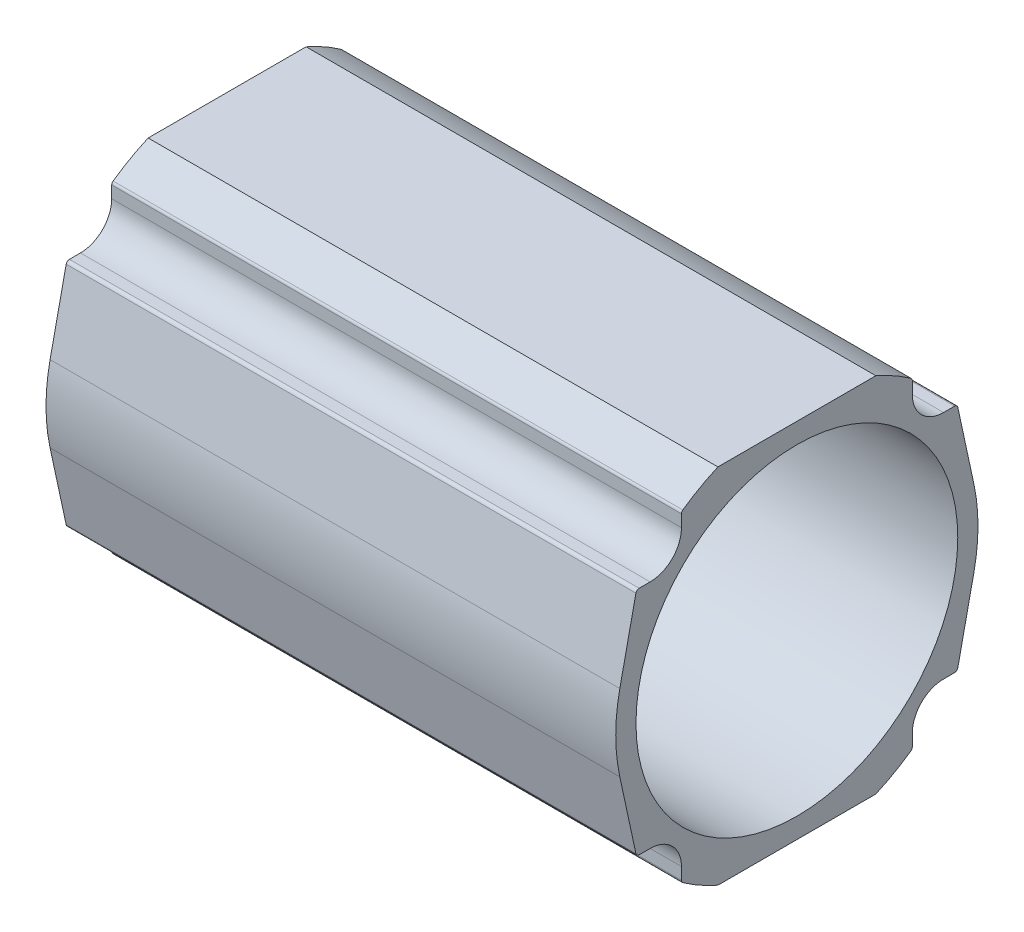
ISO-10303-21;
HEADER;
FILE_DESCRIPTION(('STEP AP214'),'2;1');
FILE_NAME('part.step','',(''),(''),'','','');
FILE_SCHEMA(('AUTOMOTIVE_DESIGN { 1 0 10303 214 1 1 1 1 }'));
ENDSEC;
DATA;
#1=APPLICATION_CONTEXT('core data for automotive mechanical design processes');
#2=APPLICATION_PROTOCOL_DEFINITION('international standard','automotive_design',2000,#1);
#3=PRODUCT_CONTEXT('',#1,'mechanical');
#4=PRODUCT('Part','Part','',(#3));
#5=PRODUCT_RELATED_PRODUCT_CATEGORY('part','',(#4));
#6=PRODUCT_DEFINITION_FORMATION('','',#4);
#7=PRODUCT_DEFINITION_CONTEXT('part definition',#1,'design');
#8=PRODUCT_DEFINITION('design','',#6,#7);
#9=PRODUCT_DEFINITION_SHAPE('','',#8);
#10=(LENGTH_UNIT() NAMED_UNIT(*) SI_UNIT(.MILLI.,.METRE.));
#11=(NAMED_UNIT(*) PLANE_ANGLE_UNIT() SI_UNIT($,.RADIAN.));
#12=(NAMED_UNIT(*) SI_UNIT($,.STERADIAN.) SOLID_ANGLE_UNIT());
#13=UNCERTAINTY_MEASURE_WITH_UNIT(LENGTH_MEASURE(1.E-05),#10,'distance_accuracy_value','');
#14=(GEOMETRIC_REPRESENTATION_CONTEXT(3) GLOBAL_UNCERTAINTY_ASSIGNED_CONTEXT((#13)) GLOBAL_UNIT_ASSIGNED_CONTEXT((#10,
#11,#12)) REPRESENTATION_CONTEXT('',''));
#15=CARTESIAN_POINT('',(0.,0.,0.));
#16=DIRECTION('',(0.,0.,1.));
#17=DIRECTION('',(1.,0.,0.));
#18=AXIS2_PLACEMENT_3D('',#15,#16,#17);
#19=CARTESIAN_POINT('',(86.5,0.,-4.40272818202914E-12));
#20=DIRECTION('',(-1.,0.,0.));
#21=DIRECTION('',(0.,0.,1.));
#22=AXIS2_PLACEMENT_3D('',#19,#20,#21);
#23=CYLINDRICAL_SURFACE('',#22,27.5000000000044);
#24=CARTESIAN_POINT('',(0.,0.,-4.40272818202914E-12));
#25=DIRECTION('',(1.,0.,0.));
#26=DIRECTION('',(0.,0.,-1.));
#27=AXIS2_PLACEMENT_3D('',#24,#25,#26);
#28=CIRCLE('',#27,27.5000000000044);
#29=CARTESIAN_POINT('',(0.,5.8043958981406,26.880457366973));
#30=VERTEX_POINT('',#29);
#31=CARTESIAN_POINT('',(0.,-5.8043958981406,26.880457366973));
#32=VERTEX_POINT('',#31);
#33=EDGE_CURVE('E243',#30,#32,#28,.T.);
#34=ORIENTED_EDGE('',*,*,#33,.T.);
#35=DIRECTION('',(-1.,0.,0.));
#36=VECTOR('',#35,1.);
#37=CARTESIAN_POINT('',(86.5,-5.8043958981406,26.880457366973));
#38=LINE('',#37,#36);
#39=CARTESIAN_POINT('',(86.5,-5.8043958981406,26.880457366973));
#40=VERTEX_POINT('',#39);
#41=EDGE_CURVE('E11',#40,#32,#38,.T.);
#42=ORIENTED_EDGE('',*,*,#41,.F.);
#43=CARTESIAN_POINT('',(86.5,0.,-4.40272818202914E-12));
#44=DIRECTION('',(1.,0.,0.));
#45=DIRECTION('',(0.,0.,-1.));
#46=AXIS2_PLACEMENT_3D('',#43,#44,#45);
#47=CIRCLE('',#46,27.5000000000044);
#48=CARTESIAN_POINT('',(86.5,5.8043958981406,26.880457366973));
#49=VERTEX_POINT('',#48);
#50=EDGE_CURVE('E323',#49,#40,#47,.T.);
#51=ORIENTED_EDGE('',*,*,#50,.F.);
#52=DIRECTION('',(-1.,0.,0.));
#53=VECTOR('',#52,1.);
#54=CARTESIAN_POINT('',(86.5,5.8043958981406,26.880457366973));
#55=LINE('',#54,#53);
#56=EDGE_CURVE('E256',#49,#30,#55,.T.);
#57=ORIENTED_EDGE('',*,*,#56,.T.);
#58=EDGE_LOOP('',(#34,#42,#51,#57));
#59=FACE_BOUND('',#58,.T.);
#60=ADVANCED_FACE('F31',(#59),#23,.T.);
#61=CARTESIAN_POINT('',(86.5,-5.8043958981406,26.880457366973));
#62=DIRECTION('',(0.,0.21106894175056,-0.977471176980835));
#63=DIRECTION('',(0.,0.977471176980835,0.21106894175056));
#64=AXIS2_PLACEMENT_3D('',#61,#62,#63);
#65=PLANE('',#64);
#66=DIRECTION('',(0.,-0.977471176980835,-0.21106894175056));
#67=VECTOR('',#66,1.);
#68=CARTESIAN_POINT('',(0.,-5.8043958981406,26.880457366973));
#69=LINE('',#68,#67);
#70=CARTESIAN_POINT('',(0.,-17.129398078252,24.435008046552));
#71=VERTEX_POINT('',#70);
#72=EDGE_CURVE('E239',#32,#71,#69,.T.);
#73=ORIENTED_EDGE('',*,*,#72,.T.);
#74=DIRECTION('',(-1.,0.,0.));
#75=VECTOR('',#74,1.);
#76=CARTESIAN_POINT('',(86.5,-17.129398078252,24.435008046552));
#77=LINE('',#76,#75);
#78=CARTESIAN_POINT('',(86.5,-17.129398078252,24.435008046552));
#79=VERTEX_POINT('',#78);
#80=EDGE_CURVE('E38',#79,#71,#77,.T.);
#81=ORIENTED_EDGE('',*,*,#80,.F.);
#82=DIRECTION('',(0.,-0.977471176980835,-0.21106894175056));
#83=VECTOR('',#82,1.);
#84=CARTESIAN_POINT('',(86.5,-5.8043958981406,26.880457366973));
#85=LINE('',#84,#83);
#86=EDGE_CURVE('E252',#40,#79,#85,.T.);
#87=ORIENTED_EDGE('',*,*,#86,.F.);
#88=ORIENTED_EDGE('',*,*,#41,.T.);
#89=EDGE_LOOP('',(#73,#81,#87,#88));
#90=FACE_BOUND('',#89,.T.);
#91=ADVANCED_FACE('F251',(#90),#65,.F.);
#92=CARTESIAN_POINT('',(86.5,-17.023863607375,23.9462724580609));
#93=DIRECTION('',(-1.,0.,0.));
#94=DIRECTION('',(0.,0.,1.));
#95=AXIS2_PLACEMENT_3D('',#92,#93,#94);
#96=CYLINDRICAL_SURFACE('',#95,0.500000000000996);
#97=CARTESIAN_POINT('',(0.,-17.023863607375,23.9462724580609));
#98=DIRECTION('',(1.,0.,0.));
#99=DIRECTION('',(0.,0.,-1.));
#100=AXIS2_PLACEMENT_3D('',#97,#98,#99);
#101=CIRCLE('',#100,0.500000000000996);
#102=CARTESIAN_POINT('',(0.,-17.523863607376,23.946272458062));
#103=VERTEX_POINT('',#102);
#104=EDGE_CURVE('E245',#71,#103,#101,.T.);
#105=ORIENTED_EDGE('',*,*,#104,.T.);
#106=DIRECTION('',(-1.,0.,0.));
#107=VECTOR('',#106,1.);
#108=CARTESIAN_POINT('',(86.5,-17.523863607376,23.946272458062));
#109=LINE('',#108,#107);
#110=CARTESIAN_POINT('',(86.5,-17.523863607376,23.946272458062));
#111=VERTEX_POINT('',#110);
#112=EDGE_CURVE('E469',#111,#103,#109,.T.);
#113=ORIENTED_EDGE('',*,*,#112,.F.);
#114=CARTESIAN_POINT('',(86.5,-17.023863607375,23.9462724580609));
#115=DIRECTION('',(1.,0.,0.));
#116=DIRECTION('',(0.,0.,-1.));
#117=AXIS2_PLACEMENT_3D('',#114,#115,#116);
#118=CIRCLE('',#117,0.500000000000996);
#119=EDGE_CURVE('E326',#79,#111,#118,.T.);
#120=ORIENTED_EDGE('',*,*,#119,.F.);
#121=ORIENTED_EDGE('',*,*,#80,.T.);
#122=EDGE_LOOP('',(#105,#113,#120,#121));
#123=FACE_BOUND('',#122,.T.);
#124=ADVANCED_FACE('F473',(#123),#96,.T.);
#125=CARTESIAN_POINT('',(86.5,-17.523863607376,23.946272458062));
#126=DIRECTION('',(0.,1.,0.));
#127=DIRECTION('',(0.,0.,1.));
#128=AXIS2_PLACEMENT_3D('',#125,#126,#127);
#129=PLANE('',#128);
#130=DIRECTION('',(0.,0.,-1.));
#131=VECTOR('',#130,1.);
#132=CARTESIAN_POINT('',(0.,-17.523863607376,23.946272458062));
#133=LINE('',#132,#131);
#134=CARTESIAN_POINT('',(0.,-17.523863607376,22.273863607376));
#135=VERTEX_POINT('',#134);
#136=EDGE_CURVE('E265',#103,#135,#133,.T.);
#137=ORIENTED_EDGE('',*,*,#136,.T.);
#138=DIRECTION('',(-1.,0.,0.));
#139=VECTOR('',#138,1.);
#140=CARTESIAN_POINT('',(86.5,-17.523863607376,22.273863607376));
#141=LINE('',#140,#139);
#142=CARTESIAN_POINT('',(86.5,-17.523863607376,22.273863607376));
#143=VERTEX_POINT('',#142);
#144=EDGE_CURVE('E466',#143,#135,#141,.T.);
#145=ORIENTED_EDGE('',*,*,#144,.F.);
#146=DIRECTION('',(0.,0.,-1.));
#147=VECTOR('',#146,1.);
#148=CARTESIAN_POINT('',(86.5,-17.523863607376,23.946272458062));
#149=LINE('',#148,#147);
#150=EDGE_CURVE('E328',#111,#143,#149,.T.);
#151=ORIENTED_EDGE('',*,*,#150,.F.);
#152=ORIENTED_EDGE('',*,*,#112,.T.);
#153=EDGE_LOOP('',(#137,#145,#151,#152));
#154=FACE_BOUND('',#153,.T.);
#155=ADVANCED_FACE('F481',(#154),#129,.F.);
#156=CARTESIAN_POINT('',(86.5,-22.2738636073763,22.2738636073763));
#157=DIRECTION('',(-1.,0.,0.));
#158=DIRECTION('',(0.,0.,1.));
#159=AXIS2_PLACEMENT_3D('',#156,#157,#158);
#160=CYLINDRICAL_SURFACE('',#159,4.75000000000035);
#161=CARTESIAN_POINT('',(0.,-22.2738636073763,22.2738636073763));
#162=DIRECTION('',(-1.,0.,0.));
#163=DIRECTION('',(0.,0.,1.));
#164=AXIS2_PLACEMENT_3D('',#161,#162,#163);
#165=CIRCLE('',#164,4.75000000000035);
#166=CARTESIAN_POINT('',(0.,-22.273863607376,17.523863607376));
#167=VERTEX_POINT('',#166);
#168=EDGE_CURVE('E267',#135,#167,#165,.T.);
#169=ORIENTED_EDGE('',*,*,#168,.T.);
#170=DIRECTION('',(-1.,0.,0.));
#171=VECTOR('',#170,1.);
#172=CARTESIAN_POINT('',(86.5,-22.273863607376,17.523863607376));
#173=LINE('',#172,#171);
#174=CARTESIAN_POINT('',(86.5,-22.273863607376,17.523863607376));
#175=VERTEX_POINT('',#174);
#176=EDGE_CURVE('E463',#175,#167,#173,.T.);
#177=ORIENTED_EDGE('',*,*,#176,.F.);
#178=CARTESIAN_POINT('',(86.5,-22.2738636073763,22.2738636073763));
#179=DIRECTION('',(-1.,0.,0.));
#180=DIRECTION('',(0.,0.,1.));
#181=AXIS2_PLACEMENT_3D('',#178,#179,#180);
#182=CIRCLE('',#181,4.75000000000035);
#183=EDGE_CURVE('E330',#143,#175,#182,.T.);
#184=ORIENTED_EDGE('',*,*,#183,.F.);
#185=ORIENTED_EDGE('',*,*,#144,.T.);
#186=EDGE_LOOP('',(#169,#177,#184,#185));
#187=FACE_BOUND('',#186,.T.);
#188=ADVANCED_FACE('F484',(#187),#160,.F.);
#189=CARTESIAN_POINT('',(86.5,-22.273863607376,17.523863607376));
#190=DIRECTION('',(0.,0.,-1.));
#191=DIRECTION('',(-1.,0.,0.));
#192=AXIS2_PLACEMENT_3D('',#189,#190,#191);
#193=PLANE('',#192);
#194=DIRECTION('',(0.,-1.,0.));
#195=VECTOR('',#194,1.);
#196=CARTESIAN_POINT('',(0.,-22.273863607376,17.523863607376));
#197=LINE('',#196,#195);
#198=CARTESIAN_POINT('',(0.,-24.092282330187,17.523863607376));
#199=VERTEX_POINT('',#198);
#200=EDGE_CURVE('E269',#167,#199,#197,.T.);
#201=ORIENTED_EDGE('',*,*,#200,.T.);
#202=DIRECTION('',(-1.,0.,0.));
#203=VECTOR('',#202,1.);
#204=CARTESIAN_POINT('',(86.5,-24.092282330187,17.523863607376));
#205=LINE('',#204,#203);
#206=CARTESIAN_POINT('',(86.5,-24.092282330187,17.523863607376));
#207=VERTEX_POINT('',#206);
#208=EDGE_CURVE('E460',#207,#199,#205,.T.);
#209=ORIENTED_EDGE('',*,*,#208,.F.);
#210=DIRECTION('',(0.,-1.,0.));
#211=VECTOR('',#210,1.);
#212=CARTESIAN_POINT('',(86.5,-22.273863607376,17.523863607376));
#213=LINE('',#212,#211);
#214=EDGE_CURVE('E332',#175,#207,#213,.T.);
#215=ORIENTED_EDGE('',*,*,#214,.F.);
#216=ORIENTED_EDGE('',*,*,#176,.T.);
#217=EDGE_LOOP('',(#201,#209,#215,#216));
#218=FACE_BOUND('',#217,.T.);
#219=ADVANCED_FACE('F489',(#218),#193,.F.);
#220=CARTESIAN_POINT('',(86.5,-24.092282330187,17.0238636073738));
#221=DIRECTION('',(-1.,0.,0.));
#222=DIRECTION('',(0.,0.,1.));
#223=AXIS2_PLACEMENT_3D('',#220,#221,#222);
#224=CYLINDRICAL_SURFACE('',#223,0.500000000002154);
#225=CARTESIAN_POINT('',(0.,-24.092282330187,17.0238636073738));
#226=DIRECTION('',(1.,0.,0.));
#227=DIRECTION('',(0.,0.,-1.));
#228=AXIS2_PLACEMENT_3D('',#225,#226,#227);
#229=CIRCLE('',#228,0.500000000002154);
#230=CARTESIAN_POINT('',(0.,-24.5006260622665,17.3124037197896));
#231=VERTEX_POINT('',#230);
#232=EDGE_CURVE('E271',#199,#231,#229,.T.);
#233=ORIENTED_EDGE('',*,*,#232,.T.);
#234=DIRECTION('',(-1.,0.,0.));
#235=VECTOR('',#234,1.);
#236=CARTESIAN_POINT('',(86.5,-24.5006260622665,17.3124037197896));
#237=LINE('',#236,#235);
#238=CARTESIAN_POINT('',(86.5,-24.5006260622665,17.3124037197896));
#239=VERTEX_POINT('',#238);
#240=EDGE_CURVE('E457',#239,#231,#237,.T.);
#241=ORIENTED_EDGE('',*,*,#240,.F.);
#242=CARTESIAN_POINT('',(86.5,-24.092282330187,17.0238636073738));
#243=DIRECTION('',(1.,0.,0.));
#244=DIRECTION('',(0.,0.,-1.));
#245=AXIS2_PLACEMENT_3D('',#242,#243,#244);
#246=CIRCLE('',#245,0.500000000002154);
#247=EDGE_CURVE('E334',#207,#239,#246,.T.);
#248=ORIENTED_EDGE('',*,*,#247,.F.);
#249=ORIENTED_EDGE('',*,*,#208,.T.);
#250=EDGE_LOOP('',(#233,#241,#248,#249));
#251=FACE_BOUND('',#250,.T.);
#252=ADVANCED_FACE('F495',(#251),#224,.T.);
#253=CARTESIAN_POINT('',(86.5,0.,-4.40272818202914E-12));
#254=DIRECTION('',(-1.,0.,0.));
#255=DIRECTION('',(0.,0.,1.));
#256=AXIS2_PLACEMENT_3D('',#253,#254,#255);
#257=CYLINDRICAL_SURFACE('',#256,30.0000000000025);
#258=CARTESIAN_POINT('',(0.,0.,-4.40272818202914E-12));
#259=DIRECTION('',(1.,0.,0.));
#260=DIRECTION('',(0.,0.,-1.));
#261=AXIS2_PLACEMENT_3D('',#258,#259,#260);
#262=CIRCLE('',#261,30.0000000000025);
#263=CARTESIAN_POINT('',(0.,-27.5,11.989578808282));
#264=VERTEX_POINT('',#263);
#265=EDGE_CURVE('E273',#231,#264,#262,.T.);
#266=ORIENTED_EDGE('',*,*,#265,.T.);
#267=DIRECTION('',(-1.,0.,0.));
#268=VECTOR('',#267,1.);
#269=CARTESIAN_POINT('',(86.5,-27.5,11.989578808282));
#270=LINE('',#269,#268);
#271=CARTESIAN_POINT('',(86.5,-27.5,11.989578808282));
#272=VERTEX_POINT('',#271);
#273=EDGE_CURVE('E454',#272,#264,#270,.T.);
#274=ORIENTED_EDGE('',*,*,#273,.F.);
#275=CARTESIAN_POINT('',(86.5,0.,-4.40272818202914E-12));
#276=DIRECTION('',(1.,0.,0.));
#277=DIRECTION('',(0.,0.,-1.));
#278=AXIS2_PLACEMENT_3D('',#275,#276,#277);
#279=CIRCLE('',#278,30.0000000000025);
#280=EDGE_CURVE('E336',#239,#272,#279,.T.);
#281=ORIENTED_EDGE('',*,*,#280,.F.);
#282=ORIENTED_EDGE('',*,*,#240,.T.);
#283=EDGE_LOOP('',(#266,#274,#281,#282));
#284=FACE_BOUND('',#283,.T.);
#285=ADVANCED_FACE('F499',(#284),#257,.T.);
#286=CARTESIAN_POINT('',(86.5,-27.5,11.989578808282));
#287=DIRECTION('',(0.,1.,0.));
#288=DIRECTION('',(0.,0.,1.));
#289=AXIS2_PLACEMENT_3D('',#286,#287,#288);
#290=PLANE('',#289);
#291=DIRECTION('',(0.,0.,-1.));
#292=VECTOR('',#291,1.);
#293=CARTESIAN_POINT('',(0.,-27.5,11.989578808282));
#294=LINE('',#293,#292);
#295=CARTESIAN_POINT('',(0.,-27.4999999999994,-11.9895788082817));
#296=VERTEX_POINT('',#295);
#297=EDGE_CURVE('E275',#264,#296,#294,.T.);
#298=ORIENTED_EDGE('',*,*,#297,.T.);
#299=DIRECTION('',(-1.,0.,0.));
#300=VECTOR('',#299,1.);
#301=CARTESIAN_POINT('',(86.5,-27.4999999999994,-11.9895788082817));
#302=LINE('',#301,#300);
#303=CARTESIAN_POINT('',(86.5,-27.4999999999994,-11.9895788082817));
#304=VERTEX_POINT('',#303);
#305=EDGE_CURVE('E451',#304,#296,#302,.T.);
#306=ORIENTED_EDGE('',*,*,#305,.F.);
#307=DIRECTION('',(0.,0.,-1.));
#308=VECTOR('',#307,1.);
#309=CARTESIAN_POINT('',(86.5,-27.5,11.989578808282));
#310=LINE('',#309,#308);
#311=EDGE_CURVE('E338',#272,#304,#310,.T.);
#312=ORIENTED_EDGE('',*,*,#311,.F.);
#313=ORIENTED_EDGE('',*,*,#273,.T.);
#314=EDGE_LOOP('',(#298,#306,#312,#313));
#315=FACE_BOUND('',#314,.T.);
#316=ADVANCED_FACE('F504',(#315),#290,.F.);
#317=CARTESIAN_POINT('',(86.5,0.,-4.40272818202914E-12));
#318=DIRECTION('',(-1.,0.,0.));
#319=DIRECTION('',(0.,0.,1.));
#320=AXIS2_PLACEMENT_3D('',#317,#318,#319);
#321=CYLINDRICAL_SURFACE('',#320,29.9999999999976);
#322=CARTESIAN_POINT('',(0.,0.,-4.40272818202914E-12));
#323=DIRECTION('',(1.,0.,0.));
#324=DIRECTION('',(0.,0.,-1.));
#325=AXIS2_PLACEMENT_3D('',#322,#323,#324);
#326=CIRCLE('',#325,29.9999999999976);
#327=CARTESIAN_POINT('',(0.,-24.500626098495,-17.312403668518));
#328=VERTEX_POINT('',#327);
#329=EDGE_CURVE('E277',#296,#328,#326,.T.);
#330=ORIENTED_EDGE('',*,*,#329,.T.);
#331=DIRECTION('',(-1.,0.,0.));
#332=VECTOR('',#331,1.);
#333=CARTESIAN_POINT('',(86.5,-24.500626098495,-17.312403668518));
#334=LINE('',#333,#332);
#335=CARTESIAN_POINT('',(86.5,-24.500626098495,-17.312403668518));
#336=VERTEX_POINT('',#335);
#337=EDGE_CURVE('E448',#336,#328,#334,.T.);
#338=ORIENTED_EDGE('',*,*,#337,.F.);
#339=CARTESIAN_POINT('',(86.5,0.,-4.40272818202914E-12));
#340=DIRECTION('',(1.,0.,0.));
#341=DIRECTION('',(0.,0.,-1.));
#342=AXIS2_PLACEMENT_3D('',#339,#340,#341);
#343=CIRCLE('',#342,29.9999999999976);
#344=EDGE_CURVE('E340',#304,#336,#343,.T.);
#345=ORIENTED_EDGE('',*,*,#344,.F.);
#346=ORIENTED_EDGE('',*,*,#305,.T.);
#347=EDGE_LOOP('',(#330,#338,#345,#346));
#348=FACE_BOUND('',#347,.T.);
#349=ADVANCED_FACE('F510',(#348),#321,.T.);
#350=CARTESIAN_POINT('',(86.5,-24.0922823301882,-17.0238636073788));
#351=DIRECTION('',(-1.,0.,0.));
#352=DIRECTION('',(0.,0.,1.));
#353=AXIS2_PLACEMENT_3D('',#350,#351,#352);
#354=CYLINDRICAL_SURFACE('',#353,0.499999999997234);
#355=CARTESIAN_POINT('',(0.,-24.0922823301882,-17.0238636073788));
#356=DIRECTION('',(1.,0.,0.));
#357=DIRECTION('',(0.,0.,-1.));
#358=AXIS2_PLACEMENT_3D('',#355,#356,#357);
#359=CIRCLE('',#358,0.499999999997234);
#360=CARTESIAN_POINT('',(0.,-24.092282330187,-17.523863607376));
#361=VERTEX_POINT('',#360);
#362=EDGE_CURVE('E279',#328,#361,#359,.T.);
#363=ORIENTED_EDGE('',*,*,#362,.T.);
#364=DIRECTION('',(-1.,0.,0.));
#365=VECTOR('',#364,1.);
#366=CARTESIAN_POINT('',(86.5,-24.092282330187,-17.523863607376));
#367=LINE('',#366,#365);
#368=CARTESIAN_POINT('',(86.5,-24.092282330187,-17.523863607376));
#369=VERTEX_POINT('',#368);
#370=EDGE_CURVE('E445',#369,#361,#367,.T.);
#371=ORIENTED_EDGE('',*,*,#370,.F.);
#372=CARTESIAN_POINT('',(86.5,-24.0922823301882,-17.0238636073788));
#373=DIRECTION('',(1.,0.,0.));
#374=DIRECTION('',(0.,0.,-1.));
#375=AXIS2_PLACEMENT_3D('',#372,#373,#374);
#376=CIRCLE('',#375,0.499999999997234);
#377=EDGE_CURVE('E342',#336,#369,#376,.T.);
#378=ORIENTED_EDGE('',*,*,#377,.F.);
#379=ORIENTED_EDGE('',*,*,#337,.T.);
#380=EDGE_LOOP('',(#363,#371,#378,#379));
#381=FACE_BOUND('',#380,.T.);
#382=ADVANCED_FACE('F514',(#381),#354,.T.);
#383=CARTESIAN_POINT('',(86.5,-24.092282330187,-17.523863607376));
#384=DIRECTION('',(0.,0.,1.));
#385=DIRECTION('',(1.,0.,0.));
#386=AXIS2_PLACEMENT_3D('',#383,#384,#385);
#387=PLANE('',#386);
#388=DIRECTION('',(0.,1.,0.));
#389=VECTOR('',#388,1.);
#390=CARTESIAN_POINT('',(0.,-24.092282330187,-17.523863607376));
#391=LINE('',#390,#389);
#392=CARTESIAN_POINT('',(0.,-22.273863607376,-17.523863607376));
#393=VERTEX_POINT('',#392);
#394=EDGE_CURVE('E281',#361,#393,#391,.T.);
#395=ORIENTED_EDGE('',*,*,#394,.T.);
#396=DIRECTION('',(-1.,0.,0.));
#397=VECTOR('',#396,1.);
#398=CARTESIAN_POINT('',(86.5,-22.273863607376,-17.523863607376));
#399=LINE('',#398,#397);
#400=CARTESIAN_POINT('',(86.5,-22.273863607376,-17.523863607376));
#401=VERTEX_POINT('',#400);
#402=EDGE_CURVE('E442',#401,#393,#399,.T.);
#403=ORIENTED_EDGE('',*,*,#402,.F.);
#404=DIRECTION('',(0.,1.,0.));
#405=VECTOR('',#404,1.);
#406=CARTESIAN_POINT('',(86.5,-24.092282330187,-17.523863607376));
#407=LINE('',#406,#405);
#408=EDGE_CURVE('E344',#369,#401,#407,.T.);
#409=ORIENTED_EDGE('',*,*,#408,.F.);
#410=ORIENTED_EDGE('',*,*,#370,.T.);
#411=EDGE_LOOP('',(#395,#403,#409,#410));
#412=FACE_BOUND('',#411,.T.);
#413=ADVANCED_FACE('F519',(#412),#387,.F.);
#414=CARTESIAN_POINT('',(86.5,-22.2738636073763,-22.2738636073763));
#415=DIRECTION('',(-1.,0.,0.));
#416=DIRECTION('',(0.,0.,1.));
#417=AXIS2_PLACEMENT_3D('',#414,#415,#416);
#418=CYLINDRICAL_SURFACE('',#417,4.75000000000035);
#419=CARTESIAN_POINT('',(0.,-22.2738636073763,-22.2738636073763));
#420=DIRECTION('',(-1.,0.,0.));
#421=DIRECTION('',(0.,0.,1.));
#422=AXIS2_PLACEMENT_3D('',#419,#420,#421);
#423=CIRCLE('',#422,4.75000000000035);
#424=CARTESIAN_POINT('',(0.,-17.523863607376,-22.273863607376));
#425=VERTEX_POINT('',#424);
#426=EDGE_CURVE('E283',#393,#425,#423,.T.);
#427=ORIENTED_EDGE('',*,*,#426,.T.);
#428=DIRECTION('',(-1.,0.,0.));
#429=VECTOR('',#428,1.);
#430=CARTESIAN_POINT('',(86.5,-17.523863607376,-22.273863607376));
#431=LINE('',#430,#429);
#432=CARTESIAN_POINT('',(86.5,-17.523863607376,-22.273863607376));
#433=VERTEX_POINT('',#432);
#434=EDGE_CURVE('E439',#433,#425,#431,.T.);
#435=ORIENTED_EDGE('',*,*,#434,.F.);
#436=CARTESIAN_POINT('',(86.5,-22.2738636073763,-22.2738636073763));
#437=DIRECTION('',(-1.,0.,0.));
#438=DIRECTION('',(0.,0.,1.));
#439=AXIS2_PLACEMENT_3D('',#436,#437,#438);
#440=CIRCLE('',#439,4.75000000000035);
#441=EDGE_CURVE('E346',#401,#433,#440,.T.);
#442=ORIENTED_EDGE('',*,*,#441,.F.);
#443=ORIENTED_EDGE('',*,*,#402,.T.);
#444=EDGE_LOOP('',(#427,#435,#442,#443));
#445=FACE_BOUND('',#444,.T.);
#446=ADVANCED_FACE('F525',(#445),#418,.F.);
#447=CARTESIAN_POINT('',(86.5,-17.523863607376,-22.273863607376));
#448=DIRECTION('',(0.,1.,0.));
#449=DIRECTION('',(0.,0.,1.));
#450=AXIS2_PLACEMENT_3D('',#447,#448,#449);
#451=PLANE('',#450);
#452=DIRECTION('',(0.,0.,-1.));
#453=VECTOR('',#452,1.);
#454=CARTESIAN_POINT('',(0.,-17.523863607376,-22.273863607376));
#455=LINE('',#454,#453);
#456=CARTESIAN_POINT('',(0.,-17.523863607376,-23.946272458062));
#457=VERTEX_POINT('',#456);
#458=EDGE_CURVE('E285',#425,#457,#455,.T.);
#459=ORIENTED_EDGE('',*,*,#458,.T.);
#460=DIRECTION('',(-1.,0.,0.));
#461=VECTOR('',#460,1.);
#462=CARTESIAN_POINT('',(86.5,-17.523863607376,-23.946272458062));
#463=LINE('',#462,#461);
#464=CARTESIAN_POINT('',(86.5,-17.523863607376,-23.946272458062));
#465=VERTEX_POINT('',#464);
#466=EDGE_CURVE('E436',#465,#457,#463,.T.);
#467=ORIENTED_EDGE('',*,*,#466,.F.);
#468=DIRECTION('',(0.,0.,-1.));
#469=VECTOR('',#468,1.);
#470=CARTESIAN_POINT('',(86.5,-17.523863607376,-22.273863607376));
#471=LINE('',#470,#469);
#472=EDGE_CURVE('E348',#433,#465,#471,.T.);
#473=ORIENTED_EDGE('',*,*,#472,.F.);
#474=ORIENTED_EDGE('',*,*,#434,.T.);
#475=EDGE_LOOP('',(#459,#467,#473,#474));
#476=FACE_BOUND('',#475,.T.);
#477=ADVANCED_FACE('F529',(#476),#451,.F.);
#478=CARTESIAN_POINT('',(86.5,-17.023863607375,-23.9462724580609));
#479=DIRECTION('',(-1.,0.,0.));
#480=DIRECTION('',(0.,0.,1.));
#481=AXIS2_PLACEMENT_3D('',#478,#479,#480);
#482=CYLINDRICAL_SURFACE('',#481,0.500000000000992);
#483=CARTESIAN_POINT('',(0.,-17.023863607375,-23.9462724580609));
#484=DIRECTION('',(1.,0.,0.));
#485=DIRECTION('',(0.,0.,-1.));
#486=AXIS2_PLACEMENT_3D('',#483,#484,#485);
#487=CIRCLE('',#486,0.500000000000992);
#488=CARTESIAN_POINT('',(0.,-17.129398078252,-24.435008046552));
#489=VERTEX_POINT('',#488);
#490=EDGE_CURVE('E287',#457,#489,#487,.T.);
#491=ORIENTED_EDGE('',*,*,#490,.T.);
#492=DIRECTION('',(-1.,0.,0.));
#493=VECTOR('',#492,1.);
#494=CARTESIAN_POINT('',(86.5,-17.129398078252,-24.435008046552));
#495=LINE('',#494,#493);
#496=CARTESIAN_POINT('',(86.5,-17.129398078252,-24.435008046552));
#497=VERTEX_POINT('',#496);
#498=EDGE_CURVE('E433',#497,#489,#495,.T.);
#499=ORIENTED_EDGE('',*,*,#498,.F.);
#500=CARTESIAN_POINT('',(86.5,-17.023863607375,-23.9462724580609));
#501=DIRECTION('',(1.,0.,0.));
#502=DIRECTION('',(0.,0.,-1.));
#503=AXIS2_PLACEMENT_3D('',#500,#501,#502);
#504=CIRCLE('',#503,0.500000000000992);
#505=EDGE_CURVE('E350',#465,#497,#504,.T.);
#506=ORIENTED_EDGE('',*,*,#505,.F.);
#507=ORIENTED_EDGE('',*,*,#466,.T.);
#508=EDGE_LOOP('',(#491,#499,#506,#507));
#509=FACE_BOUND('',#508,.T.);
#510=ADVANCED_FACE('F534',(#509),#482,.T.);
#511=CARTESIAN_POINT('',(86.5,-17.129398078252,-24.435008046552));
#512=DIRECTION('',(0.,0.21106894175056,0.977471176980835));
#513=DIRECTION('',(0.,-0.977471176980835,0.21106894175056));
#514=AXIS2_PLACEMENT_3D('',#511,#512,#513);
#515=PLANE('',#514);
#516=DIRECTION('',(0.,0.977471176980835,-0.21106894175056));
#517=VECTOR('',#516,1.);
#518=CARTESIAN_POINT('',(0.,-17.129398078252,-24.435008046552));
#519=LINE('',#518,#517);
#520=CARTESIAN_POINT('',(0.,-5.8043958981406,-26.880457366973));
#521=VERTEX_POINT('',#520);
#522=EDGE_CURVE('E289',#489,#521,#519,.T.);
#523=ORIENTED_EDGE('',*,*,#522,.T.);
#524=DIRECTION('',(-1.,0.,0.));
#525=VECTOR('',#524,1.);
#526=CARTESIAN_POINT('',(86.5,-5.8043958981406,-26.880457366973));
#527=LINE('',#526,#525);
#528=CARTESIAN_POINT('',(86.5,-5.8043958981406,-26.880457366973));
#529=VERTEX_POINT('',#528);
#530=EDGE_CURVE('E430',#529,#521,#527,.T.);
#531=ORIENTED_EDGE('',*,*,#530,.F.);
#532=DIRECTION('',(0.,0.977471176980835,-0.21106894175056));
#533=VECTOR('',#532,1.);
#534=CARTESIAN_POINT('',(86.5,-17.129398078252,-24.435008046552));
#535=LINE('',#534,#533);
#536=EDGE_CURVE('E352',#497,#529,#535,.T.);
#537=ORIENTED_EDGE('',*,*,#536,.F.);
#538=ORIENTED_EDGE('',*,*,#498,.T.);
#539=EDGE_LOOP('',(#523,#531,#537,#538));
#540=FACE_BOUND('',#539,.T.);
#541=ADVANCED_FACE('F540',(#540),#515,.F.);
#542=CARTESIAN_POINT('',(86.5,0.,-4.40272818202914E-12));
#543=DIRECTION('',(-1.,0.,0.));
#544=DIRECTION('',(0.,0.,1.));
#545=AXIS2_PLACEMENT_3D('',#542,#543,#544);
#546=CYLINDRICAL_SURFACE('',#545,27.4999999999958);
#547=CARTESIAN_POINT('',(0.,0.,-4.40272818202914E-12));
#548=DIRECTION('',(1.,0.,0.));
#549=DIRECTION('',(0.,0.,-1.));
#550=AXIS2_PLACEMENT_3D('',#547,#548,#549);
#551=CIRCLE('',#550,27.4999999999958);
#552=CARTESIAN_POINT('',(0.,5.8043958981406,-26.880457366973));
#553=VERTEX_POINT('',#552);
#554=EDGE_CURVE('E291',#521,#553,#551,.T.);
#555=ORIENTED_EDGE('',*,*,#554,.T.);
#556=DIRECTION('',(-1.,0.,0.));
#557=VECTOR('',#556,1.);
#558=CARTESIAN_POINT('',(86.5,5.8043958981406,-26.880457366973));
#559=LINE('',#558,#557);
#560=CARTESIAN_POINT('',(86.5,5.8043958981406,-26.880457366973));
#561=VERTEX_POINT('',#560);
#562=EDGE_CURVE('E427',#561,#553,#559,.T.);
#563=ORIENTED_EDGE('',*,*,#562,.F.);
#564=CARTESIAN_POINT('',(86.5,0.,-4.40272818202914E-12));
#565=DIRECTION('',(1.,0.,0.));
#566=DIRECTION('',(0.,0.,-1.));
#567=AXIS2_PLACEMENT_3D('',#564,#565,#566);
#568=CIRCLE('',#567,27.4999999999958);
#569=EDGE_CURVE('E354',#529,#561,#568,.T.);
#570=ORIENTED_EDGE('',*,*,#569,.F.);
#571=ORIENTED_EDGE('',*,*,#530,.T.);
#572=EDGE_LOOP('',(#555,#563,#570,#571));
#573=FACE_BOUND('',#572,.T.);
#574=ADVANCED_FACE('F544',(#573),#546,.T.);
#575=CARTESIAN_POINT('',(86.5,5.8043958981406,-26.880457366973));
#576=DIRECTION('',(0.,-0.21106894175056,0.977471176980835));
#577=DIRECTION('',(0.,-0.977471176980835,-0.21106894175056));
#578=AXIS2_PLACEMENT_3D('',#575,#576,#577);
#579=PLANE('',#578);
#580=DIRECTION('',(0.,0.977471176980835,0.21106894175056));
#581=VECTOR('',#580,1.);
#582=CARTESIAN_POINT('',(0.,5.8043958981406,-26.880457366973));
#583=LINE('',#582,#581);
#584=CARTESIAN_POINT('',(0.,17.129398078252,-24.435008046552));
#585=VERTEX_POINT('',#584);
#586=EDGE_CURVE('E293',#553,#585,#583,.T.);
#587=ORIENTED_EDGE('',*,*,#586,.T.);
#588=DIRECTION('',(-1.,0.,0.));
#589=VECTOR('',#588,1.);
#590=CARTESIAN_POINT('',(86.5,17.129398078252,-24.435008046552));
#591=LINE('',#590,#589);
#592=CARTESIAN_POINT('',(86.5,17.129398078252,-24.435008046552));
#593=VERTEX_POINT('',#592);
#594=EDGE_CURVE('E424',#593,#585,#591,.T.);
#595=ORIENTED_EDGE('',*,*,#594,.F.);
#596=DIRECTION('',(0.,0.977471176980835,0.21106894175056));
#597=VECTOR('',#596,1.);
#598=CARTESIAN_POINT('',(86.5,5.8043958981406,-26.880457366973));
#599=LINE('',#598,#597);
#600=EDGE_CURVE('E356',#561,#593,#599,.T.);
#601=ORIENTED_EDGE('',*,*,#600,.F.);
#602=ORIENTED_EDGE('',*,*,#562,.T.);
#603=EDGE_LOOP('',(#587,#595,#601,#602));
#604=FACE_BOUND('',#603,.T.);
#605=ADVANCED_FACE('F549',(#604),#579,.F.);
#606=CARTESIAN_POINT('',(86.5,17.023863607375,-23.9462724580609));
#607=DIRECTION('',(-1.,0.,0.));
#608=DIRECTION('',(0.,0.,1.));
#609=AXIS2_PLACEMENT_3D('',#606,#607,#608);
#610=CYLINDRICAL_SURFACE('',#609,0.500000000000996);
#611=CARTESIAN_POINT('',(0.,17.023863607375,-23.9462724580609));
#612=DIRECTION('',(1.,0.,0.));
#613=DIRECTION('',(0.,0.,-1.));
#614=AXIS2_PLACEMENT_3D('',#611,#612,#613);
#615=CIRCLE('',#614,0.500000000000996);
#616=CARTESIAN_POINT('',(0.,17.523863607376,-23.946272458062));
#617=VERTEX_POINT('',#616);
#618=EDGE_CURVE('E295',#585,#617,#615,.T.);
#619=ORIENTED_EDGE('',*,*,#618,.T.);
#620=DIRECTION('',(-1.,0.,0.));
#621=VECTOR('',#620,1.);
#622=CARTESIAN_POINT('',(86.5,17.523863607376,-23.946272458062));
#623=LINE('',#622,#621);
#624=CARTESIAN_POINT('',(86.5,17.523863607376,-23.946272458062));
#625=VERTEX_POINT('',#624);
#626=EDGE_CURVE('E421',#625,#617,#623,.T.);
#627=ORIENTED_EDGE('',*,*,#626,.F.);
#628=CARTESIAN_POINT('',(86.5,17.023863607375,-23.9462724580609));
#629=DIRECTION('',(1.,0.,0.));
#630=DIRECTION('',(0.,0.,-1.));
#631=AXIS2_PLACEMENT_3D('',#628,#629,#630);
#632=CIRCLE('',#631,0.500000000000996);
#633=EDGE_CURVE('E358',#593,#625,#632,.T.);
#634=ORIENTED_EDGE('',*,*,#633,.F.);
#635=ORIENTED_EDGE('',*,*,#594,.T.);
#636=EDGE_LOOP('',(#619,#627,#634,#635));
#637=FACE_BOUND('',#636,.T.);
#638=ADVANCED_FACE('F555',(#637),#610,.T.);
#639=CARTESIAN_POINT('',(86.5,17.523863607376,-23.946272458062));
#640=DIRECTION('',(0.,-1.,0.));
#641=DIRECTION('',(0.,0.,-1.));
#642=AXIS2_PLACEMENT_3D('',#639,#640,#641);
#643=PLANE('',#642);
#644=DIRECTION('',(0.,0.,1.));
#645=VECTOR('',#644,1.);
#646=CARTESIAN_POINT('',(0.,17.523863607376,-23.946272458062));
#647=LINE('',#646,#645);
#648=CARTESIAN_POINT('',(0.,17.523863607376,-22.273863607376));
#649=VERTEX_POINT('',#648);
#650=EDGE_CURVE('E297',#617,#649,#647,.T.);
#651=ORIENTED_EDGE('',*,*,#650,.T.);
#652=DIRECTION('',(-1.,0.,0.));
#653=VECTOR('',#652,1.);
#654=CARTESIAN_POINT('',(86.5,17.523863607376,-22.273863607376));
#655=LINE('',#654,#653);
#656=CARTESIAN_POINT('',(86.5,17.523863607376,-22.273863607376));
#657=VERTEX_POINT('',#656);
#658=EDGE_CURVE('E418',#657,#649,#655,.T.);
#659=ORIENTED_EDGE('',*,*,#658,.F.);
#660=DIRECTION('',(0.,0.,1.));
#661=VECTOR('',#660,1.);
#662=CARTESIAN_POINT('',(86.5,17.523863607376,-23.946272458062));
#663=LINE('',#662,#661);
#664=EDGE_CURVE('E360',#625,#657,#663,.T.);
#665=ORIENTED_EDGE('',*,*,#664,.F.);
#666=ORIENTED_EDGE('',*,*,#626,.T.);
#667=EDGE_LOOP('',(#651,#659,#665,#666));
#668=FACE_BOUND('',#667,.T.);
#669=ADVANCED_FACE('F559',(#668),#643,.F.);
#670=CARTESIAN_POINT('',(86.5,22.2738636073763,-22.2738636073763));
#671=DIRECTION('',(-1.,0.,0.));
#672=DIRECTION('',(0.,0.,1.));
#673=AXIS2_PLACEMENT_3D('',#670,#671,#672);
#674=CYLINDRICAL_SURFACE('',#673,4.75000000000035);
#675=CARTESIAN_POINT('',(0.,22.2738636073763,-22.2738636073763));
#676=DIRECTION('',(-1.,0.,0.));
#677=DIRECTION('',(0.,0.,1.));
#678=AXIS2_PLACEMENT_3D('',#675,#676,#677);
#679=CIRCLE('',#678,4.75000000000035);
#680=CARTESIAN_POINT('',(0.,22.273863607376,-17.523863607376));
#681=VERTEX_POINT('',#680);
#682=EDGE_CURVE('E299',#649,#681,#679,.T.);
#683=ORIENTED_EDGE('',*,*,#682,.T.);
#684=DIRECTION('',(-1.,0.,0.));
#685=VECTOR('',#684,1.);
#686=CARTESIAN_POINT('',(86.5,22.273863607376,-17.523863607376));
#687=LINE('',#686,#685);
#688=CARTESIAN_POINT('',(86.5,22.273863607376,-17.523863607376));
#689=VERTEX_POINT('',#688);
#690=EDGE_CURVE('E415',#689,#681,#687,.T.);
#691=ORIENTED_EDGE('',*,*,#690,.F.);
#692=CARTESIAN_POINT('',(86.5,22.2738636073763,-22.2738636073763));
#693=DIRECTION('',(-1.,0.,0.));
#694=DIRECTION('',(0.,0.,1.));
#695=AXIS2_PLACEMENT_3D('',#692,#693,#694);
#696=CIRCLE('',#695,4.75000000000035);
#697=EDGE_CURVE('E362',#657,#689,#696,.T.);
#698=ORIENTED_EDGE('',*,*,#697,.F.);
#699=ORIENTED_EDGE('',*,*,#658,.T.);
#700=EDGE_LOOP('',(#683,#691,#698,#699));
#701=FACE_BOUND('',#700,.T.);
#702=ADVANCED_FACE('F564',(#701),#674,.F.);
#703=CARTESIAN_POINT('',(86.5,22.273863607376,-17.523863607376));
#704=DIRECTION('',(0.,0.,1.));
#705=DIRECTION('',(1.,0.,0.));
#706=AXIS2_PLACEMENT_3D('',#703,#704,#705);
#707=PLANE('',#706);
#708=DIRECTION('',(0.,1.,0.));
#709=VECTOR('',#708,1.);
#710=CARTESIAN_POINT('',(0.,22.273863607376,-17.523863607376));
#711=LINE('',#710,#709);
#712=CARTESIAN_POINT('',(0.,24.092282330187,-17.523863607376));
#713=VERTEX_POINT('',#712);
#714=EDGE_CURVE('E301',#681,#713,#711,.T.);
#715=ORIENTED_EDGE('',*,*,#714,.T.);
#716=DIRECTION('',(-1.,0.,0.));
#717=VECTOR('',#716,1.);
#718=CARTESIAN_POINT('',(86.5,24.092282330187,-17.523863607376));
#719=LINE('',#718,#717);
#720=CARTESIAN_POINT('',(86.5,24.092282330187,-17.523863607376));
#721=VERTEX_POINT('',#720);
#722=EDGE_CURVE('E412',#721,#713,#719,.T.);
#723=ORIENTED_EDGE('',*,*,#722,.F.);
#724=DIRECTION('',(0.,1.,0.));
#725=VECTOR('',#724,1.);
#726=CARTESIAN_POINT('',(86.5,22.273863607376,-17.523863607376));
#727=LINE('',#726,#725);
#728=EDGE_CURVE('E364',#689,#721,#727,.T.);
#729=ORIENTED_EDGE('',*,*,#728,.F.);
#730=ORIENTED_EDGE('',*,*,#690,.T.);
#731=EDGE_LOOP('',(#715,#723,#729,#730));
#732=FACE_BOUND('',#731,.T.);
#733=ADVANCED_FACE('F570',(#732),#707,.F.);
#734=CARTESIAN_POINT('',(86.5,24.0922823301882,-17.0238636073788));
#735=DIRECTION('',(-1.,0.,0.));
#736=DIRECTION('',(0.,0.,1.));
#737=AXIS2_PLACEMENT_3D('',#734,#735,#736);
#738=CYLINDRICAL_SURFACE('',#737,0.499999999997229);
#739=CARTESIAN_POINT('',(0.,24.0922823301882,-17.0238636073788));
#740=DIRECTION('',(1.,0.,0.));
#741=DIRECTION('',(0.,0.,-1.));
#742=AXIS2_PLACEMENT_3D('',#739,#740,#741);
#743=CIRCLE('',#742,0.499999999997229);
#744=CARTESIAN_POINT('',(0.,24.5006260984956,-17.3124036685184));
#745=VERTEX_POINT('',#744);
#746=EDGE_CURVE('E303',#713,#745,#743,.T.);
#747=ORIENTED_EDGE('',*,*,#746,.T.);
#748=DIRECTION('',(-1.,0.,0.));
#749=VECTOR('',#748,1.);
#750=CARTESIAN_POINT('',(86.5,24.5006260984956,-17.3124036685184));
#751=LINE('',#750,#749);
#752=CARTESIAN_POINT('',(86.5,24.5006260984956,-17.3124036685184));
#753=VERTEX_POINT('',#752);
#754=EDGE_CURVE('E409',#753,#745,#751,.T.);
#755=ORIENTED_EDGE('',*,*,#754,.F.);
#756=CARTESIAN_POINT('',(86.5,24.0922823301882,-17.0238636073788));
#757=DIRECTION('',(1.,0.,0.));
#758=DIRECTION('',(0.,0.,-1.));
#759=AXIS2_PLACEMENT_3D('',#756,#757,#758);
#760=CIRCLE('',#759,0.499999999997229);
#761=EDGE_CURVE('E366',#721,#753,#760,.T.);
#762=ORIENTED_EDGE('',*,*,#761,.F.);
#763=ORIENTED_EDGE('',*,*,#722,.T.);
#764=EDGE_LOOP('',(#747,#755,#762,#763));
#765=FACE_BOUND('',#764,.T.);
#766=ADVANCED_FACE('F574',(#765),#738,.T.);
#767=CARTESIAN_POINT('',(86.5,0.,-4.40272818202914E-12));
#768=DIRECTION('',(-1.,0.,0.));
#769=DIRECTION('',(0.,0.,1.));
#770=AXIS2_PLACEMENT_3D('',#767,#768,#769);
#771=CYLINDRICAL_SURFACE('',#770,29.9999999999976);
#772=CARTESIAN_POINT('',(0.,0.,-4.40272818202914E-12));
#773=DIRECTION('',(1.,0.,0.));
#774=DIRECTION('',(0.,0.,-1.));
#775=AXIS2_PLACEMENT_3D('',#772,#773,#774);
#776=CIRCLE('',#775,29.9999999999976);
#777=CARTESIAN_POINT('',(0.,27.5,-11.989578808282));
#778=VERTEX_POINT('',#777);
#779=EDGE_CURVE('E305',#745,#778,#776,.T.);
#780=ORIENTED_EDGE('',*,*,#779,.T.);
#781=DIRECTION('',(-1.,0.,0.));
#782=VECTOR('',#781,1.);
#783=CARTESIAN_POINT('',(86.5,27.5,-11.989578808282));
#784=LINE('',#783,#782);
#785=CARTESIAN_POINT('',(86.5,27.5,-11.989578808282));
#786=VERTEX_POINT('',#785);
#787=EDGE_CURVE('E406',#786,#778,#784,.T.);
#788=ORIENTED_EDGE('',*,*,#787,.F.);
#789=CARTESIAN_POINT('',(86.5,0.,-4.40272818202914E-12));
#790=DIRECTION('',(1.,0.,0.));
#791=DIRECTION('',(0.,0.,-1.));
#792=AXIS2_PLACEMENT_3D('',#789,#790,#791);
#793=CIRCLE('',#792,29.9999999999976);
#794=EDGE_CURVE('E368',#753,#786,#793,.T.);
#795=ORIENTED_EDGE('',*,*,#794,.F.);
#796=ORIENTED_EDGE('',*,*,#754,.T.);
#797=EDGE_LOOP('',(#780,#788,#795,#796));
#798=FACE_BOUND('',#797,.T.);
#799=ADVANCED_FACE('F579',(#798),#771,.T.);
#800=CARTESIAN_POINT('',(86.5,27.5,-11.989578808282));
#801=DIRECTION('',(0.,-1.,0.));
#802=DIRECTION('',(0.,0.,-1.));
#803=AXIS2_PLACEMENT_3D('',#800,#801,#802);
#804=PLANE('',#803);
#805=DIRECTION('',(0.,0.,1.));
#806=VECTOR('',#805,1.);
#807=CARTESIAN_POINT('',(0.,27.5,-11.989578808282));
#808=LINE('',#807,#806);
#809=CARTESIAN_POINT('',(0.,27.5000000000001,11.989578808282));
#810=VERTEX_POINT('',#809);
#811=EDGE_CURVE('E307',#778,#810,#808,.T.);
#812=ORIENTED_EDGE('',*,*,#811,.T.);
#813=DIRECTION('',(-1.,0.,0.));
#814=VECTOR('',#813,1.);
#815=CARTESIAN_POINT('',(86.5,27.5000000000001,11.989578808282));
#816=LINE('',#815,#814);
#817=CARTESIAN_POINT('',(86.5,27.5000000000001,11.989578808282));
#818=VERTEX_POINT('',#817);
#819=EDGE_CURVE('E403',#818,#810,#816,.T.);
#820=ORIENTED_EDGE('',*,*,#819,.F.);
#821=DIRECTION('',(0.,0.,1.));
#822=VECTOR('',#821,1.);
#823=CARTESIAN_POINT('',(86.5,27.5,-11.989578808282));
#824=LINE('',#823,#822);
#825=EDGE_CURVE('E370',#786,#818,#824,.T.);
#826=ORIENTED_EDGE('',*,*,#825,.F.);
#827=ORIENTED_EDGE('',*,*,#787,.T.);
#828=EDGE_LOOP('',(#812,#820,#826,#827));
#829=FACE_BOUND('',#828,.T.);
#830=ADVANCED_FACE('F585',(#829),#804,.F.);
#831=CARTESIAN_POINT('',(86.5,0.,-4.40272818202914E-12));
#832=DIRECTION('',(-1.,0.,0.));
#833=DIRECTION('',(0.,0.,1.));
#834=AXIS2_PLACEMENT_3D('',#831,#832,#833);
#835=CYLINDRICAL_SURFACE('',#834,30.0000000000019);
#836=CARTESIAN_POINT('',(0.,0.,-4.40272818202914E-12));
#837=DIRECTION('',(1.,0.,0.));
#838=DIRECTION('',(0.,0.,-1.));
#839=AXIS2_PLACEMENT_3D('',#836,#837,#838);
#840=CIRCLE('',#839,30.0000000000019);
#841=CARTESIAN_POINT('',(0.,24.500626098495,17.312403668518));
#842=VERTEX_POINT('',#841);
#843=EDGE_CURVE('E309',#810,#842,#840,.T.);
#844=ORIENTED_EDGE('',*,*,#843,.T.);
#845=DIRECTION('',(-1.,0.,0.));
#846=VECTOR('',#845,1.);
#847=CARTESIAN_POINT('',(86.5,24.500626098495,17.312403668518));
#848=LINE('',#847,#846);
#849=CARTESIAN_POINT('',(86.5,24.500626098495,17.312403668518));
#850=VERTEX_POINT('',#849);
#851=EDGE_CURVE('E400',#850,#842,#848,.T.);
#852=ORIENTED_EDGE('',*,*,#851,.F.);
#853=CARTESIAN_POINT('',(86.5,0.,-4.40272818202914E-12));
#854=DIRECTION('',(1.,0.,0.));
#855=DIRECTION('',(0.,0.,-1.));
#856=AXIS2_PLACEMENT_3D('',#853,#854,#855);
#857=CIRCLE('',#856,30.0000000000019);
#858=EDGE_CURVE('E372',#818,#850,#857,.T.);
#859=ORIENTED_EDGE('',*,*,#858,.F.);
#860=ORIENTED_EDGE('',*,*,#819,.T.);
#861=EDGE_LOOP('',(#844,#852,#859,#860));
#862=FACE_BOUND('',#861,.T.);
#863=ADVANCED_FACE('F589',(#862),#835,.T.);
#864=CARTESIAN_POINT('',(86.5,24.0922823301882,17.0238636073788));
#865=DIRECTION('',(-1.,0.,0.));
#866=DIRECTION('',(0.,0.,1.));
#867=AXIS2_PLACEMENT_3D('',#864,#865,#866);
#868=CYLINDRICAL_SURFACE('',#867,0.499999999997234);
#869=CARTESIAN_POINT('',(0.,24.0922823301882,17.0238636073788));
#870=DIRECTION('',(1.,0.,0.));
#871=DIRECTION('',(0.,0.,-1.));
#872=AXIS2_PLACEMENT_3D('',#869,#870,#871);
#873=CIRCLE('',#872,0.499999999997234);
#874=CARTESIAN_POINT('',(0.,24.092282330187,17.523863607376));
#875=VERTEX_POINT('',#874);
#876=EDGE_CURVE('E311',#842,#875,#873,.T.);
#877=ORIENTED_EDGE('',*,*,#876,.T.);
#878=DIRECTION('',(-1.,0.,0.));
#879=VECTOR('',#878,1.);
#880=CARTESIAN_POINT('',(86.5,24.092282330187,17.523863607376));
#881=LINE('',#880,#879);
#882=CARTESIAN_POINT('',(86.5,24.092282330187,17.523863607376));
#883=VERTEX_POINT('',#882);
#884=EDGE_CURVE('E397',#883,#875,#881,.T.);
#885=ORIENTED_EDGE('',*,*,#884,.F.);
#886=CARTESIAN_POINT('',(86.5,24.0922823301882,17.0238636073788));
#887=DIRECTION('',(1.,0.,0.));
#888=DIRECTION('',(0.,0.,-1.));
#889=AXIS2_PLACEMENT_3D('',#886,#887,#888);
#890=CIRCLE('',#889,0.499999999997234);
#891=EDGE_CURVE('E374',#850,#883,#890,.T.);
#892=ORIENTED_EDGE('',*,*,#891,.F.);
#893=ORIENTED_EDGE('',*,*,#851,.T.);
#894=EDGE_LOOP('',(#877,#885,#892,#893));
#895=FACE_BOUND('',#894,.T.);
#896=ADVANCED_FACE('F594',(#895),#868,.T.);
#897=CARTESIAN_POINT('',(86.5,24.092282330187,17.523863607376));
#898=DIRECTION('',(0.,0.,-1.));
#899=DIRECTION('',(-1.,0.,0.));
#900=AXIS2_PLACEMENT_3D('',#897,#898,#899);
#901=PLANE('',#900);
#902=DIRECTION('',(0.,-1.,0.));
#903=VECTOR('',#902,1.);
#904=CARTESIAN_POINT('',(0.,24.092282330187,17.523863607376));
#905=LINE('',#904,#903);
#906=CARTESIAN_POINT('',(0.,22.273863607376,17.523863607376));
#907=VERTEX_POINT('',#906);
#908=EDGE_CURVE('E313',#875,#907,#905,.T.);
#909=ORIENTED_EDGE('',*,*,#908,.T.);
#910=DIRECTION('',(-1.,0.,0.));
#911=VECTOR('',#910,1.);
#912=CARTESIAN_POINT('',(86.5,22.273863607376,17.523863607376));
#913=LINE('',#912,#911);
#914=CARTESIAN_POINT('',(86.5,22.273863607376,17.523863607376));
#915=VERTEX_POINT('',#914);
#916=EDGE_CURVE('E394',#915,#907,#913,.T.);
#917=ORIENTED_EDGE('',*,*,#916,.F.);
#918=DIRECTION('',(0.,-1.,0.));
#919=VECTOR('',#918,1.);
#920=CARTESIAN_POINT('',(86.5,24.092282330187,17.523863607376));
#921=LINE('',#920,#919);
#922=EDGE_CURVE('E376',#883,#915,#921,.T.);
#923=ORIENTED_EDGE('',*,*,#922,.F.);
#924=ORIENTED_EDGE('',*,*,#884,.T.);
#925=EDGE_LOOP('',(#909,#917,#923,#924));
#926=FACE_BOUND('',#925,.T.);
#927=ADVANCED_FACE('F600',(#926),#901,.F.);
#928=CARTESIAN_POINT('',(86.5,22.2738636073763,22.2738636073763));
#929=DIRECTION('',(-1.,0.,0.));
#930=DIRECTION('',(0.,0.,1.));
#931=AXIS2_PLACEMENT_3D('',#928,#929,#930);
#932=CYLINDRICAL_SURFACE('',#931,4.75000000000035);
#933=CARTESIAN_POINT('',(0.,22.2738636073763,22.2738636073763));
#934=DIRECTION('',(-1.,0.,0.));
#935=DIRECTION('',(0.,0.,1.));
#936=AXIS2_PLACEMENT_3D('',#933,#934,#935);
#937=CIRCLE('',#936,4.75000000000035);
#938=CARTESIAN_POINT('',(0.,17.523863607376,22.273863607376));
#939=VERTEX_POINT('',#938);
#940=EDGE_CURVE('E315',#907,#939,#937,.T.);
#941=ORIENTED_EDGE('',*,*,#940,.T.);
#942=DIRECTION('',(-1.,0.,0.));
#943=VECTOR('',#942,1.);
#944=CARTESIAN_POINT('',(86.5,17.523863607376,22.273863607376));
#945=LINE('',#944,#943);
#946=CARTESIAN_POINT('',(86.5,17.523863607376,22.273863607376));
#947=VERTEX_POINT('',#946);
#948=EDGE_CURVE('E391',#947,#939,#945,.T.);
#949=ORIENTED_EDGE('',*,*,#948,.F.);
#950=CARTESIAN_POINT('',(86.5,22.2738636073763,22.2738636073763));
#951=DIRECTION('',(-1.,0.,0.));
#952=DIRECTION('',(0.,0.,1.));
#953=AXIS2_PLACEMENT_3D('',#950,#951,#952);
#954=CIRCLE('',#953,4.75000000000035);
#955=EDGE_CURVE('E378',#915,#947,#954,.T.);
#956=ORIENTED_EDGE('',*,*,#955,.F.);
#957=ORIENTED_EDGE('',*,*,#916,.T.);
#958=EDGE_LOOP('',(#941,#949,#956,#957));
#959=FACE_BOUND('',#958,.T.);
#960=ADVANCED_FACE('F604',(#959),#932,.F.);
#961=CARTESIAN_POINT('',(86.5,17.523863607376,22.273863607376));
#962=DIRECTION('',(0.,-1.,0.));
#963=DIRECTION('',(0.,0.,-1.));
#964=AXIS2_PLACEMENT_3D('',#961,#962,#963);
#965=PLANE('',#964);
#966=DIRECTION('',(0.,0.,1.));
#967=VECTOR('',#966,1.);
#968=CARTESIAN_POINT('',(0.,17.523863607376,22.273863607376));
#969=LINE('',#968,#967);
#970=CARTESIAN_POINT('',(0.,17.523863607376,23.946272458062));
#971=VERTEX_POINT('',#970);
#972=EDGE_CURVE('E317',#939,#971,#969,.T.);
#973=ORIENTED_EDGE('',*,*,#972,.T.);
#974=DIRECTION('',(-1.,0.,0.));
#975=VECTOR('',#974,1.);
#976=CARTESIAN_POINT('',(86.5,17.523863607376,23.946272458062));
#977=LINE('',#976,#975);
#978=CARTESIAN_POINT('',(86.5,17.523863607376,23.946272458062));
#979=VERTEX_POINT('',#978);
#980=EDGE_CURVE('E388',#979,#971,#977,.T.);
#981=ORIENTED_EDGE('',*,*,#980,.F.);
#982=DIRECTION('',(0.,0.,1.));
#983=VECTOR('',#982,1.);
#984=CARTESIAN_POINT('',(86.5,17.523863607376,22.273863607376));
#985=LINE('',#984,#983);
#986=EDGE_CURVE('E380',#947,#979,#985,.T.);
#987=ORIENTED_EDGE('',*,*,#986,.F.);
#988=ORIENTED_EDGE('',*,*,#948,.T.);
#989=EDGE_LOOP('',(#973,#981,#987,#988));
#990=FACE_BOUND('',#989,.T.);
#991=ADVANCED_FACE('F609',(#990),#965,.F.);
#992=CARTESIAN_POINT('',(86.5,17.023863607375,23.9462724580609));
#993=DIRECTION('',(-1.,0.,0.));
#994=DIRECTION('',(0.,0.,1.));
#995=AXIS2_PLACEMENT_3D('',#992,#993,#994);
#996=CYLINDRICAL_SURFACE('',#995,0.500000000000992);
#997=CARTESIAN_POINT('',(0.,17.023863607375,23.9462724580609));
#998=DIRECTION('',(1.,0.,0.));
#999=DIRECTION('',(0.,0.,-1.));
#1000=AXIS2_PLACEMENT_3D('',#997,#998,#999);
#1001=CIRCLE('',#1000,0.500000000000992);
#1002=CARTESIAN_POINT('',(0.,17.129398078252,24.435008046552));
#1003=VERTEX_POINT('',#1002);
#1004=EDGE_CURVE('E319',#971,#1003,#1001,.T.);
#1005=ORIENTED_EDGE('',*,*,#1004,.T.);
#1006=DIRECTION('',(-1.,0.,0.));
#1007=VECTOR('',#1006,1.);
#1008=CARTESIAN_POINT('',(86.5,17.129398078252,24.435008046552));
#1009=LINE('',#1008,#1007);
#1010=CARTESIAN_POINT('',(86.5,17.129398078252,24.435008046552));
#1011=VERTEX_POINT('',#1010);
#1012=EDGE_CURVE('E385',#1011,#1003,#1009,.T.);
#1013=ORIENTED_EDGE('',*,*,#1012,.F.);
#1014=CARTESIAN_POINT('',(86.5,17.023863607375,23.9462724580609));
#1015=DIRECTION('',(1.,0.,0.));
#1016=DIRECTION('',(0.,0.,-1.));
#1017=AXIS2_PLACEMENT_3D('',#1014,#1015,#1016);
#1018=CIRCLE('',#1017,0.500000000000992);
#1019=EDGE_CURVE('E50',#979,#1011,#1018,.T.);
#1020=ORIENTED_EDGE('',*,*,#1019,.F.);
#1021=ORIENTED_EDGE('',*,*,#980,.T.);
#1022=EDGE_LOOP('',(#1005,#1013,#1020,#1021));
#1023=FACE_BOUND('',#1022,.T.);
#1024=ADVANCED_FACE('F612',(#1023),#996,.T.);
#1025=CARTESIAN_POINT('',(86.5,17.129398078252,24.435008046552));
#1026=DIRECTION('',(0.,-0.21106894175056,-0.977471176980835));
#1027=DIRECTION('',(0.,0.977471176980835,-0.21106894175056));
#1028=AXIS2_PLACEMENT_3D('',#1025,#1026,#1027);
#1029=PLANE('',#1028);
#1030=DIRECTION('',(0.,-0.977471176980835,0.21106894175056));
#1031=VECTOR('',#1030,1.);
#1032=CARTESIAN_POINT('',(0.,17.129398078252,24.435008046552));
#1033=LINE('',#1032,#1031);
#1034=EDGE_CURVE('E321',#1003,#30,#1033,.T.);
#1035=ORIENTED_EDGE('',*,*,#1034,.T.);
#1036=ORIENTED_EDGE('',*,*,#56,.F.);
#1037=DIRECTION('',(0.,-0.977471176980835,0.21106894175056));
#1038=VECTOR('',#1037,1.);
#1039=CARTESIAN_POINT('',(86.5,17.129398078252,24.435008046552));
#1040=LINE('',#1039,#1038);
#1041=EDGE_CURVE('E45',#1011,#49,#1040,.T.);
#1042=ORIENTED_EDGE('',*,*,#1041,.F.);
#1043=ORIENTED_EDGE('',*,*,#1012,.T.);
#1044=EDGE_LOOP('',(#1035,#1036,#1042,#1043));
#1045=FACE_BOUND('',#1044,.T.);
#1046=ADVANCED_FACE('F614',(#1045),#1029,.F.);
#1047=CARTESIAN_POINT('',(86.5,0.,-4.40272818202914E-12));
#1048=DIRECTION('',(1.,0.,0.));
#1049=DIRECTION('',(0.,0.,-1.));
#1050=AXIS2_PLACEMENT_3D('',#1047,#1048,#1049);
#1051=PLANE('',#1050);
#1052=CARTESIAN_POINT('',(86.5,0.,0.));
#1053=DIRECTION('',(1.,0.,0.));
#1054=DIRECTION('',(0.,0.,-1.));
#1055=AXIS2_PLACEMENT_3D('',#1052,#1053,#1054);
#1056=CIRCLE('',#1055,24.4283747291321);
#1057=CARTESIAN_POINT('',(86.5,0.,-24.4283747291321));
#1058=VERTEX_POINT('',#1057);
#1059=EDGE_CURVE('E260',#1058,#1058,#1056,.T.);
#1060=ORIENTED_EDGE('',*,*,#1059,.F.);
#1061=EDGE_LOOP('',(#1060));
#1062=FACE_BOUND('',#1061,.T.);
#1063=ORIENTED_EDGE('',*,*,#50,.T.);
#1064=ORIENTED_EDGE('',*,*,#86,.T.);
#1065=ORIENTED_EDGE('',*,*,#119,.T.);
#1066=ORIENTED_EDGE('',*,*,#150,.T.);
#1067=ORIENTED_EDGE('',*,*,#183,.T.);
#1068=ORIENTED_EDGE('',*,*,#214,.T.);
#1069=ORIENTED_EDGE('',*,*,#247,.T.);
#1070=ORIENTED_EDGE('',*,*,#280,.T.);
#1071=ORIENTED_EDGE('',*,*,#311,.T.);
#1072=ORIENTED_EDGE('',*,*,#344,.T.);
#1073=ORIENTED_EDGE('',*,*,#377,.T.);
#1074=ORIENTED_EDGE('',*,*,#408,.T.);
#1075=ORIENTED_EDGE('',*,*,#441,.T.);
#1076=ORIENTED_EDGE('',*,*,#472,.T.);
#1077=ORIENTED_EDGE('',*,*,#505,.T.);
#1078=ORIENTED_EDGE('',*,*,#536,.T.);
#1079=ORIENTED_EDGE('',*,*,#569,.T.);
#1080=ORIENTED_EDGE('',*,*,#600,.T.);
#1081=ORIENTED_EDGE('',*,*,#633,.T.);
#1082=ORIENTED_EDGE('',*,*,#664,.T.);
#1083=ORIENTED_EDGE('',*,*,#697,.T.);
#1084=ORIENTED_EDGE('',*,*,#728,.T.);
#1085=ORIENTED_EDGE('',*,*,#761,.T.);
#1086=ORIENTED_EDGE('',*,*,#794,.T.);
#1087=ORIENTED_EDGE('',*,*,#825,.T.);
#1088=ORIENTED_EDGE('',*,*,#858,.T.);
#1089=ORIENTED_EDGE('',*,*,#891,.T.);
#1090=ORIENTED_EDGE('',*,*,#922,.T.);
#1091=ORIENTED_EDGE('',*,*,#955,.T.);
#1092=ORIENTED_EDGE('',*,*,#986,.T.);
#1093=ORIENTED_EDGE('',*,*,#1019,.T.);
#1094=ORIENTED_EDGE('',*,*,#1041,.T.);
#1095=EDGE_LOOP('',(#1063,#1064,#1065,#1066,#1067,#1068,#1069,#1070,#1071,#1072,#1073,#1074,
#1075,#1076,#1077,#1078,#1079,#1080,#1081,#1082,#1083,#1084,#1085,#1086,#1087,#1088,#1089,#1090,
#1091,#1092,#1093,#1094));
#1096=FACE_BOUND('',#1095,.T.);
#1097=ADVANCED_FACE('F476',(#1062,#1096),#1051,.T.);
#1098=CARTESIAN_POINT('',(0.,0.,-4.40272818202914E-12));
#1099=DIRECTION('',(1.,0.,0.));
#1100=DIRECTION('',(0.,0.,-1.));
#1101=AXIS2_PLACEMENT_3D('',#1098,#1099,#1100);
#1102=PLANE('',#1101);
#1103=CARTESIAN_POINT('',(0.,0.,0.));
#1104=DIRECTION('',(1.,0.,0.));
#1105=DIRECTION('',(0.,0.,-1.));
#1106=AXIS2_PLACEMENT_3D('',#1103,#1104,#1105);
#1107=CIRCLE('',#1106,24.4283747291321);
#1108=CARTESIAN_POINT('',(0.,0.,-24.4283747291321));
#1109=VERTEX_POINT('',#1108);
#1110=EDGE_CURVE('E257',#1109,#1109,#1107,.T.);
#1111=ORIENTED_EDGE('',*,*,#1110,.T.);
#1112=EDGE_LOOP('',(#1111));
#1113=FACE_BOUND('',#1112,.T.);
#1114=ORIENTED_EDGE('',*,*,#33,.F.);
#1115=ORIENTED_EDGE('',*,*,#1034,.F.);
#1116=ORIENTED_EDGE('',*,*,#1004,.F.);
#1117=ORIENTED_EDGE('',*,*,#972,.F.);
#1118=ORIENTED_EDGE('',*,*,#940,.F.);
#1119=ORIENTED_EDGE('',*,*,#908,.F.);
#1120=ORIENTED_EDGE('',*,*,#876,.F.);
#1121=ORIENTED_EDGE('',*,*,#843,.F.);
#1122=ORIENTED_EDGE('',*,*,#811,.F.);
#1123=ORIENTED_EDGE('',*,*,#779,.F.);
#1124=ORIENTED_EDGE('',*,*,#746,.F.);
#1125=ORIENTED_EDGE('',*,*,#714,.F.);
#1126=ORIENTED_EDGE('',*,*,#682,.F.);
#1127=ORIENTED_EDGE('',*,*,#650,.F.);
#1128=ORIENTED_EDGE('',*,*,#618,.F.);
#1129=ORIENTED_EDGE('',*,*,#586,.F.);
#1130=ORIENTED_EDGE('',*,*,#554,.F.);
#1131=ORIENTED_EDGE('',*,*,#522,.F.);
#1132=ORIENTED_EDGE('',*,*,#490,.F.);
#1133=ORIENTED_EDGE('',*,*,#458,.F.);
#1134=ORIENTED_EDGE('',*,*,#426,.F.);
#1135=ORIENTED_EDGE('',*,*,#394,.F.);
#1136=ORIENTED_EDGE('',*,*,#362,.F.);
#1137=ORIENTED_EDGE('',*,*,#329,.F.);
#1138=ORIENTED_EDGE('',*,*,#297,.F.);
#1139=ORIENTED_EDGE('',*,*,#265,.F.);
#1140=ORIENTED_EDGE('',*,*,#232,.F.);
#1141=ORIENTED_EDGE('',*,*,#200,.F.);
#1142=ORIENTED_EDGE('',*,*,#168,.F.);
#1143=ORIENTED_EDGE('',*,*,#136,.F.);
#1144=ORIENTED_EDGE('',*,*,#104,.F.);
#1145=ORIENTED_EDGE('',*,*,#72,.F.);
#1146=EDGE_LOOP('',(#1114,#1115,#1116,#1117,#1118,#1119,#1120,#1121,#1122,#1123,#1124,#1125,
#1126,#1127,#1128,#1129,#1130,#1131,#1132,#1133,#1134,#1135,#1136,#1137,#1138,#1139,#1140,#1141,
#1142,#1143,#1144,#1145));
#1147=FACE_BOUND('',#1146,.T.);
#1148=ADVANCED_FACE('F240',(#1113,#1147),#1102,.F.);
#1149=CARTESIAN_POINT('',(0.,0.,0.));
#1150=DIRECTION('',(1.,0.,0.));
#1151=DIRECTION('',(0.,0.,-1.));
#1152=AXIS2_PLACEMENT_3D('',#1149,#1150,#1151);
#1153=CYLINDRICAL_SURFACE('',#1152,24.4283747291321);
#1154=ORIENTED_EDGE('',*,*,#1110,.F.);
#1155=EDGE_LOOP('',(#1154));
#1156=FACE_BOUND('',#1155,.T.);
#1157=ORIENTED_EDGE('',*,*,#1059,.T.);
#1158=EDGE_LOOP('',(#1157));
#1159=FACE_BOUND('',#1158,.T.);
#1160=ADVANCED_FACE('F713',(#1156,#1159),#1153,.F.);
#1161=CLOSED_SHELL('',(#60,#91,#124,#155,#188,#219,#252,#285,#316,#349,#382,#413,#446,#477,#510,
#541,#574,#605,#638,#669,#702,#733,#766,#799,#830,#863,#896,#927,#960,#991,#1024,#1046,#1097,
#1148,#1160));
#1162=MANIFOLD_SOLID_BREP('B2',#1161);
#1163=ADVANCED_BREP_SHAPE_REPRESENTATION('',(#18,#1162),#14);
#1164=SHAPE_DEFINITION_REPRESENTATION(#9,#1163);
ENDSEC;
END-ISO-10303-21;
